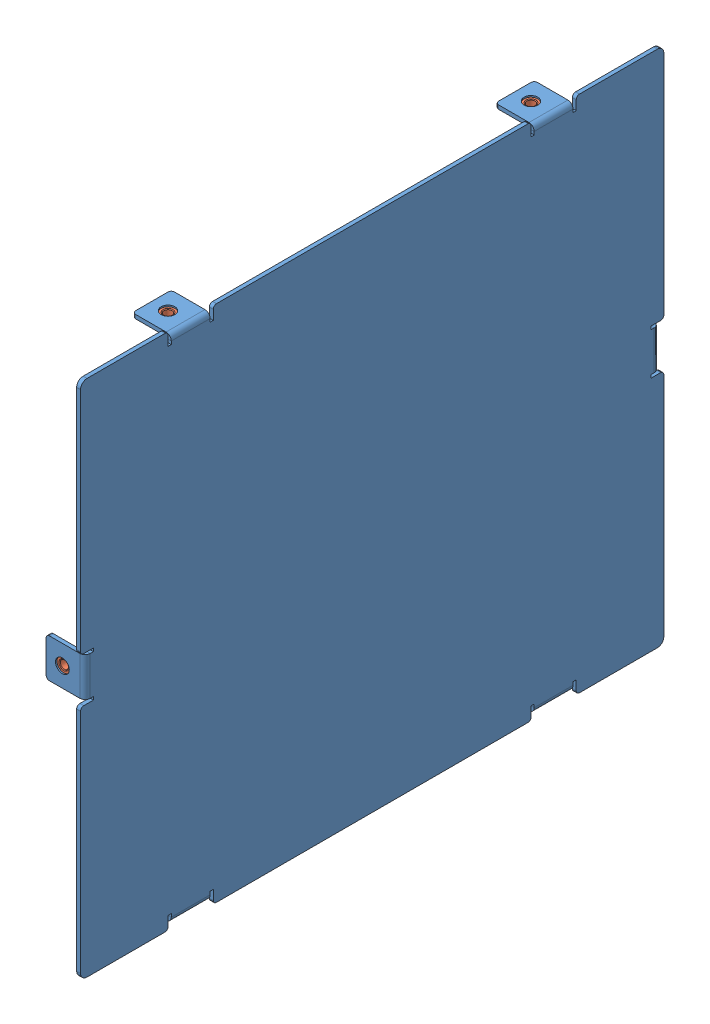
SolidWorks assembly 机箱上盖.SLDASM, configuration 默认 (file format 9000). Lengths in mm.
Overall size (12 160 180).
7 component instances, 2 part files, 12 mates.
Components (placement in the parent):
- 机箱上盖-1: 机箱上盖.SLDPRT [默认] at (54.8 -12.9392 -13.2834) x (0 0 -1) z (0 1 0) size (180 12 160)
- PEM S-M3-0 ZI--C-1: PEM S-M3-0 ZI--C.SLDPRT [默认] at (49 -90.3392 42.7166) size (6.3 2.26 6.3)
- PEM S-M3-0 ZI--C-2: PEM S-M3-0 ZI--C.SLDPRT [默认] at (49 -90.3392 -69.2834) x (0.982082 0 -0.188455) z (0.188455 0 0.982082) size (6.3 2.26 6.3)
- PEM S-M3-0 ZI--C-4: PEM S-M3-0 ZI--C.SLDPRT [默认] at (49 -12.9392 -100.6834) x (0.828287 0.560305 0) z (0.560305 -0.828287 0) size (6.3 2.26 6.3)
- PEM S-M3-0 ZI--C-6: PEM S-M3-0 ZI--C.SLDPRT [默认] at (49 64.4608 -69.2834) x (0.341569 0 0.939857) z (0.939857 0 -0.341569) size (6.3 2.26 6.3)
- PEM S-M3-0 ZI--C-8: PEM S-M3-0 ZI--C.SLDPRT [默认] at (49 64.4608 42.7166) x (0.107255 0 0.994232) z (0.994232 0 -0.107255) size (6.3 2.26 6.3)
- PEM S-M3-0 ZI--C-10: PEM S-M3-0 ZI--C.SLDPRT [默认] at (49 -12.9392 74.1166) x (0.685279 -0.728281 0) z (0.728281 0.685279 0) size (6.3 2.26 6.3)
Mates (geometry in assembly coordinates):
- 同心1: concentric anti-aligned: cylinder of 机箱上盖-1 through (49 -92.9392 42.7166) axis (0 1 0) radius 2.125; cylinder of PEM S-M3-0 ZI--C-1 through (49 -89.0892 42.7166) axis (0 -1 0) radius 3.15
- 重合1: coincident anti-aligned: plane of 机箱上盖-1 through (54.8 -90.3392 -13.2834) normal (0 1 0); plane of PEM S-M3-0 ZI--C-1 through (46.1285 -90.3392 45.588) normal (0 -1 0)
- 同心2: concentric anti-aligned: cylinder of 机箱上盖-1 through (49 -92.9392 -69.2834) axis (0 1 0) radius 2.125; cylinder of PEM S-M3-0 ZI--C-2 through (49 -89.0892 -69.2834) axis (0 -1 0) radius 3.15
- 重合2: coincident anti-aligned: plane of 机箱上盖-1 through (54.8 -90.3392 -13.2834) normal (0 1 0); plane of PEM S-M3-0 ZI--C-2 through (46.7211 -90.3392 -65.9223) normal (0 -1 0)
- 同心3: concentric anti-aligned: cylinder of 机箱上盖-1 through (49 -12.9392 -103.2834) axis (0 0 1) radius 2.125; cylinder of PEM S-M3-0 ZI--C-4 through (49 -12.9392 -99.4334) axis (0 0 -1) radius 3.15
- 重合3: coincident anti-aligned: plane of 机箱上盖-1 through (54.8 -12.9392 -100.6834) normal (0 0 1); plane of PEM S-M3-0 ZI--C-4 through (48.2305 -16.9265 -100.6834) normal (0 0 -1)
- 同心4: concentric aligned: cylinder of 机箱上盖-1 through (49 -92.9392 -69.2834) axis (0 1 0) radius 2.125; cylinder of PEM S-M3-0 ZI--C-6 through (49 63.2108 -69.2834) axis (0 1 0) radius 3.15
- 重合4: coincident anti-aligned: plane of 机箱上盖-1 through (54.8 64.4608 -13.2834) normal (0 -1 0); plane of PEM S-M3-0 ZI--C-6 through (50.718 64.4608 -72.963) normal (0 1 0)
- 同心5: concentric aligned: cylinder of 机箱上盖-1 through (49 -92.9392 42.7166) axis (0 1 0) radius 2.125; cylinder of PEM S-M3-0 ZI--C-8 through (49 63.2108 42.7166) axis (0 1 0) radius 3.15
- 重合5: coincident anti-aligned: plane of 机箱上盖-1 through (54.8 64.4608 -13.2834) normal (0 -1 0); plane of PEM S-M3-0 ZI--C-8 through (51.5469 64.4608 39.5537) normal (0 1 0)
- 同心6: concentric aligned: cylinder of 机箱上盖-1 through (49 -12.9392 -103.2834) axis (0 0 1) radius 2.125; cylinder of PEM S-M3-0 ZI--C-10 through (49 -12.9392 72.8666) axis (0 0 1) radius 3.15
- 重合6: coincident anti-aligned: plane of 机箱上盖-1 through (54.8 -12.9392 74.1166) normal (0 0 -1); plane of PEM S-M3-0 ZI--C-10 through (49.1235 -8.8802 74.1166) normal (0 0 1)
